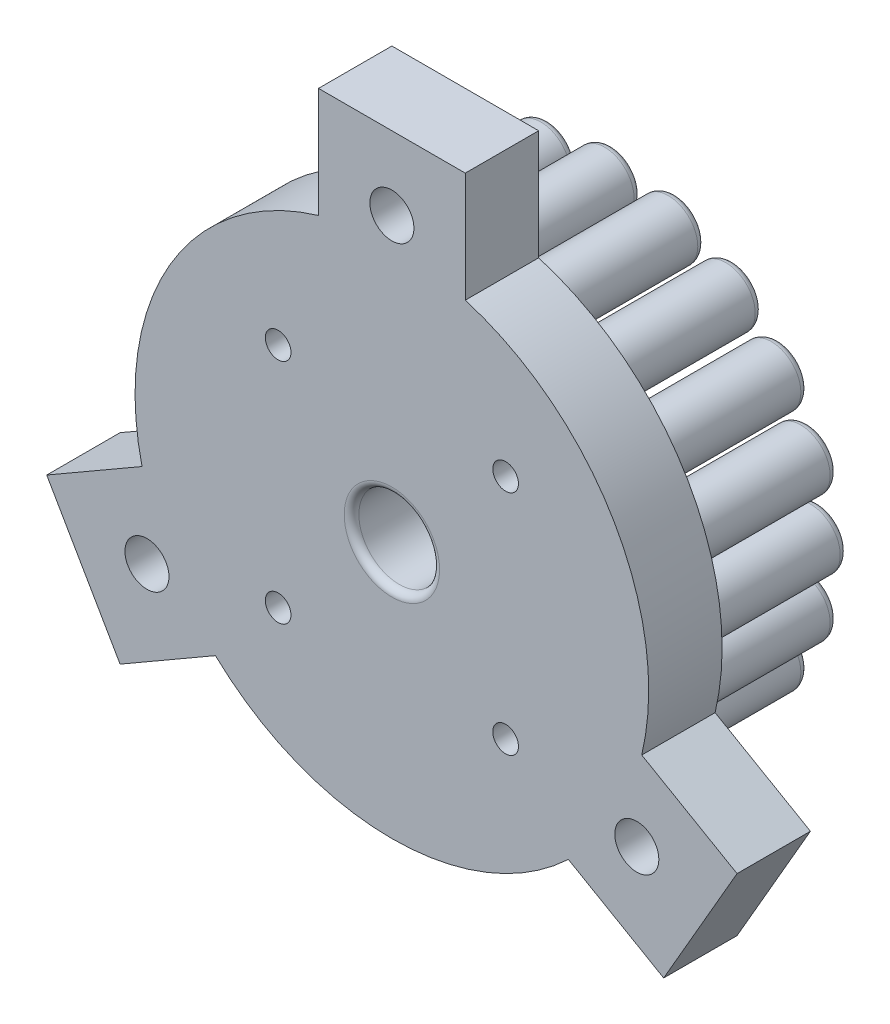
from build123d import *

# Parameters (mm, degrees)
SKIZZE1_R                          = 4
AUFSATZ_LINEAR_AUSTRAGEN1_DEPTH    = 20
AUFSATZ_LINEAR_AUSTRAGEN1_2_DEPTH  = 20
AUFSATZ_LINEAR_AUSTRAGEN1_3_DEPTH  = 20
AUFSATZ_LINEAR_AUSTRAGEN1_4_DEPTH  = 20
AUFSATZ_LINEAR_AUSTRAGEN1_5_DEPTH  = 20
AUFSATZ_LINEAR_AUSTRAGEN1_6_DEPTH  = 20
AUFSATZ_LINEAR_AUSTRAGEN1_7_DEPTH  = 20
AUFSATZ_LINEAR_AUSTRAGEN1_8_DEPTH  = 20
AUFSATZ_LINEAR_AUSTRAGEN1_9_DEPTH  = 20
AUFSATZ_LINEAR_AUSTRAGEN1_10_DEPTH = 20
AUFSATZ_LINEAR_AUSTRAGEN1_11_DEPTH = 20
AUFSATZ_LINEAR_AUSTRAGEN1_12_DEPTH = 20
AUFSATZ_LINEAR_AUSTRAGEN1_13_DEPTH = 20
AUFSATZ_LINEAR_AUSTRAGEN1_14_DEPTH = 20
AUFSATZ_LINEAR_AUSTRAGEN1_15_DEPTH = 20
AUFSATZ_LINEAR_AUSTRAGEN1_16_DEPTH = 20
AUFSATZ_LINEAR_AUSTRAGEN1_17_DEPTH = 20
AUFSATZ_LINEAR_AUSTRAGEN1_18_DEPTH = 20
AUFSATZ_LINEAR_AUSTRAGEN1_19_DEPTH = 20
AUFSATZ_LINEAR_AUSTRAGEN1_20_DEPTH = 20
SKIZZE5_R                          = 35
AUFSATZ_LINEAR_AUSTRAGEN2_DEPTH    = 10
SKIZZE6_R                          = 5.5
SCHNITT_LINEAR_AUSTRAGEN1_DEPTH    = 10
SKIZZE7_W                          = 20
SKIZZE7_H                          = 15
AUFSATZ_LINEAR_AUSTRAGEN3_DEPTH    = 10
SCHNITT_LINEAR_AUSTRAGEN3_REACH    = 75.951
SKIZZE9_R                          = 3
VERRUNDUNG1_R                      = 1
VERRUNDUNG2_R                      = 1
SKIZZE10_R                         = 1.75
SCHNITT_LINEAR_AUSTRAGEN4_DEPTH    = 10
SKIZZE12_R                         = 3.3
SCHNITT_LINEAR_AUSTRAGEN5_DEPTH    = 3


with BuildPart() as part:
    # Skizze1 → Aufsatz-Linear austragen1 (new body)
    with BuildSketch(Plane.XY):
        with Locations((0, 28.1)):
            Circle(SKIZZE1_R)
    extrude(amount=AUFSATZ_LINEAR_AUSTRAGEN1_DEPTH)



with BuildPart() as body_2:
    # Skizze1 → Aufsatz-Linear austragen1 2 (new body)
    with BuildSketch(Plane.XY):
        with Locations((8.683377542, 26.724688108)):
            Circle(SKIZZE1_R)
    extrude(amount=AUFSATZ_LINEAR_AUSTRAGEN1_2_DEPTH)


with BuildPart() as body_3:
    # Skizze1 → Aufsatz-Linear austragen1 3 (new body)
    with BuildSketch(Plane.XY):
        with Locations((16.516765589, 22.733377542)):
            Circle(SKIZZE1_R)
    extrude(amount=AUFSATZ_LINEAR_AUSTRAGEN1_3_DEPTH)


with BuildPart() as body_4:
    # Skizze1 → Aufsatz-Linear austragen1 4 (new body)
    with BuildSketch(Plane.XY):
        with Locations((22.733377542, 16.516765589)):
            Circle(SKIZZE1_R)
    extrude(amount=AUFSATZ_LINEAR_AUSTRAGEN1_4_DEPTH)


with BuildPart() as body_5:
    # Skizze1 → Aufsatz-Linear austragen1 5 (new body)
    with BuildSketch(Plane.XY):
        with Locations((26.724688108, 8.683377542)):
            Circle(SKIZZE1_R)
    extrude(amount=AUFSATZ_LINEAR_AUSTRAGEN1_5_DEPTH)


with BuildPart() as body_6:
    # Skizze1 → Aufsatz-Linear austragen1 6 (new body)
    with BuildSketch(Plane.XY):
        with Locations((28.1, 0)):
            Circle(SKIZZE1_R)
    extrude(amount=AUFSATZ_LINEAR_AUSTRAGEN1_6_DEPTH)


with BuildPart() as body_7:
    # Skizze1 → Aufsatz-Linear austragen1 7 (new body)
    with BuildSketch(Plane.XY):
        with Locations((26.724688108, -8.683377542)):
            Circle(SKIZZE1_R)
    extrude(amount=AUFSATZ_LINEAR_AUSTRAGEN1_7_DEPTH)


with BuildPart() as body_8:
    # Skizze1 → Aufsatz-Linear austragen1 8 (new body)
    with BuildSketch(Plane.XY):
        with Locations((22.733377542, -16.516765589)):
            Circle(SKIZZE1_R)
    extrude(amount=AUFSATZ_LINEAR_AUSTRAGEN1_8_DEPTH)


with BuildPart() as body_9:
    # Skizze1 → Aufsatz-Linear austragen1 9 (new body)
    with BuildSketch(Plane.XY):
        with Locations((16.516765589, -22.733377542)):
            Circle(SKIZZE1_R)
    extrude(amount=AUFSATZ_LINEAR_AUSTRAGEN1_9_DEPTH)


with BuildPart() as body_10:
    # Skizze1 → Aufsatz-Linear austragen1 10 (new body)
    with BuildSketch(Plane.XY):
        with Locations((8.683377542, -26.724688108)):
            Circle(SKIZZE1_R)
    extrude(amount=AUFSATZ_LINEAR_AUSTRAGEN1_10_DEPTH)


with BuildPart() as body_11:
    # Skizze1 → Aufsatz-Linear austragen1 11 (new body)
    with BuildSketch(Plane.XY):
        with Locations((0, -28.1)):
            Circle(SKIZZE1_R)
    extrude(amount=AUFSATZ_LINEAR_AUSTRAGEN1_11_DEPTH)


with BuildPart() as body_12:
    # Skizze1 → Aufsatz-Linear austragen1 12 (new body)
    with BuildSketch(Plane.XY):
        with Locations((-8.683377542, -26.724688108)):
            Circle(SKIZZE1_R)
    extrude(amount=AUFSATZ_LINEAR_AUSTRAGEN1_12_DEPTH)


with BuildPart() as body_13:
    # Skizze1 → Aufsatz-Linear austragen1 13 (new body)
    with BuildSketch(Plane.XY):
        with Locations((-16.516765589, -22.733377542)):
            Circle(SKIZZE1_R)
    extrude(amount=AUFSATZ_LINEAR_AUSTRAGEN1_13_DEPTH)


with BuildPart() as body_14:
    # Skizze1 → Aufsatz-Linear austragen1 14 (new body)
    with BuildSketch(Plane.XY):
        with Locations((-22.733377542, -16.516765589)):
            Circle(SKIZZE1_R)
    extrude(amount=AUFSATZ_LINEAR_AUSTRAGEN1_14_DEPTH)


with BuildPart() as body_15:
    # Skizze1 → Aufsatz-Linear austragen1 15 (new body)
    with BuildSketch(Plane.XY):
        with Locations((-26.724688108, -8.683377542)):
            Circle(SKIZZE1_R)
    extrude(amount=AUFSATZ_LINEAR_AUSTRAGEN1_15_DEPTH)


with BuildPart() as body_16:
    # Skizze1 → Aufsatz-Linear austragen1 16 (new body)
    with BuildSketch(Plane.XY):
        with Locations((-28.1, 0)):
            Circle(SKIZZE1_R)
    extrude(amount=AUFSATZ_LINEAR_AUSTRAGEN1_16_DEPTH)


with BuildPart() as body_17:
    # Skizze1 → Aufsatz-Linear austragen1 17 (new body)
    with BuildSketch(Plane.XY):
        with Locations((-26.724688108, 8.683377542)):
            Circle(SKIZZE1_R)
    extrude(amount=AUFSATZ_LINEAR_AUSTRAGEN1_17_DEPTH)


with BuildPart() as body_18:
    # Skizze1 → Aufsatz-Linear austragen1 18 (new body)
    with BuildSketch(Plane.XY):
        with Locations((-22.733377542, 16.516765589)):
            Circle(SKIZZE1_R)
    extrude(amount=AUFSATZ_LINEAR_AUSTRAGEN1_18_DEPTH)


with BuildPart() as body_19:
    # Skizze1 → Aufsatz-Linear austragen1 19 (new body)
    with BuildSketch(Plane.XY):
        with Locations((-16.516765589, 22.733377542)):
            Circle(SKIZZE1_R)
    extrude(amount=AUFSATZ_LINEAR_AUSTRAGEN1_19_DEPTH)


with BuildPart() as body_20:
    # Skizze1 → Aufsatz-Linear austragen1 20 (new body)
    with BuildSketch(Plane.XY):
        with Locations((-8.683377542, 26.724688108)):
            Circle(SKIZZE1_R)
    extrude(amount=AUFSATZ_LINEAR_AUSTRAGEN1_20_DEPTH)


with BuildPart() as part_1:
    add(part.part)

    add(body_2.part)  # Aufsatz-Linear austragen2 merges body 2

    add(body_3.part)  # Aufsatz-Linear austragen2 merges body 3

    add(body_4.part)  # Aufsatz-Linear austragen2 merges body 4

    add(body_5.part)  # Aufsatz-Linear austragen2 merges body 5

    add(body_6.part)  # Aufsatz-Linear austragen2 merges body 6

    add(body_7.part)  # Aufsatz-Linear austragen2 merges body 7

    add(body_8.part)  # Aufsatz-Linear austragen2 merges body 8

    add(body_9.part)  # Aufsatz-Linear austragen2 merges body 9

    add(body_10.part)  # Aufsatz-Linear austragen2 merges body 10

    add(body_11.part)  # Aufsatz-Linear austragen2 merges body 11

    add(body_12.part)  # Aufsatz-Linear austragen2 merges body 12

    add(body_13.part)  # Aufsatz-Linear austragen2 merges body 13

    add(body_14.part)  # Aufsatz-Linear austragen2 merges body 14

    add(body_15.part)  # Aufsatz-Linear austragen2 merges body 15

    add(body_16.part)  # Aufsatz-Linear austragen2 merges body 16

    add(body_17.part)  # Aufsatz-Linear austragen2 merges body 17

    add(body_18.part)  # Aufsatz-Linear austragen2 merges body 18

    add(body_19.part)  # Aufsatz-Linear austragen2 merges body 19

    add(body_20.part)  # Aufsatz-Linear austragen2 merges body 20
    # Skizze5 → Aufsatz-Linear austragen2 (add)
    with BuildSketch(Plane.XY.offset(20)):
        Circle(SKIZZE5_R)
    extrude(amount=AUFSATZ_LINEAR_AUSTRAGEN2_DEPTH)

    # Skizze6 → Schnitt-Linear austragen1 (cut)
    with BuildSketch(Plane.XY.offset(30)):
        Circle(SKIZZE6_R)
    extrude(amount=-SCHNITT_LINEAR_AUSTRAGEN1_DEPTH, mode=Mode.SUBTRACT)

    # Skizze7 → Aufsatz-Linear austragen3 (add)
    with BuildSketch(Plane.XY.offset(30)):
        with Locations((0, 41.041019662)):
            Rectangle(SKIZZE7_W, SKIZZE7_H)
        Polygon((34.047375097, -8.110255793), (47.037756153, -15.610255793), (37.037756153, -32.930763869), (24.047375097, -25.430763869), align=None)
        Polygon((-24.047375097, -25.430763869), (-37.037756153, -32.930763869), (-47.037756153, -15.610255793), (-34.047375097, -8.110255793), align=None)
    extrude(amount=-AUFSATZ_LINEAR_AUSTRAGEN3_DEPTH)

    # Skizze9 → Schnitt-Linear austragen3 (cut, up to next)
    with BuildSketch(Plane.XY.offset(30), mode=Mode.PRIVATE) as schnitt_linear_austragen3_sk1:
        with Locations((0, 38.541019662)):
            Circle(SKIZZE9_R)
    schnitt_linear_austragen3_tool1 = extrude(schnitt_linear_austragen3_sk1.sketch, amount=-SCHNITT_LINEAR_AUSTRAGEN3_REACH, mode=Mode.PRIVATE) & part_1.part
    # Skizze9 → Schnitt-Linear austragen3 (cut, up to next)
    with BuildSketch(Plane.XY.offset(30), mode=Mode.PRIVATE) as schnitt_linear_austragen3_sk2:
        with Locations((33.377502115, -19.270509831)):
            Circle(SKIZZE9_R)
    schnitt_linear_austragen3_tool2 = extrude(schnitt_linear_austragen3_sk2.sketch, amount=-SCHNITT_LINEAR_AUSTRAGEN3_REACH, mode=Mode.PRIVATE) & part_1.part
    # Skizze9 → Schnitt-Linear austragen3 (cut, up to next)
    with BuildSketch(Plane.XY.offset(30), mode=Mode.PRIVATE) as schnitt_linear_austragen3_sk3:
        with Locations((-33.377502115, -19.270509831)):
            Circle(SKIZZE9_R)
    schnitt_linear_austragen3_tool3 = extrude(schnitt_linear_austragen3_sk3.sketch, amount=-SCHNITT_LINEAR_AUSTRAGEN3_REACH, mode=Mode.PRIVATE) & part_1.part
    add(schnitt_linear_austragen3_tool1.solids().sort_by_distance((0, 38.54102, 30))[0], mode=Mode.SUBTRACT)
    add(schnitt_linear_austragen3_tool2.solids().sort_by_distance((33.377502, -19.27051, 30))[0], mode=Mode.SUBTRACT)
    add(schnitt_linear_austragen3_tool3.solids().sort_by_distance((-33.377502, -19.27051, 30))[0], mode=Mode.SUBTRACT)

    # Verrundung1
    verrundung1_edges = [part_1.edges().sort_by_distance(p)[0] for p in [
        (-5.5, 0, 20),
        (-5.5, 0, 30),
    ]]
    fillet(verrundung1_edges, radius=VERRUNDUNG1_R)

    # Verrundung2
    verrundung2_edges = [part_1.edges().sort_by_distance(p)[0] for p in [
        (24.1, 0, 0),
        (-26.733377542, -16.516765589, 0),
        (-30.724688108, -8.683377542, 0),
        (-32.1, 0, 0),
        (-30.724688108, 8.683377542, 0),
        (-26.733377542, 16.516765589, 0),
        (-20.516765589, 22.733377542, 0),
        (-12.683377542, 26.724688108, 0),
        (22.724688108, 8.683377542, 0),
        (18.733377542, 16.516765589, 0),
        (12.516765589, 22.733377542, 0),
        (4.683377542, 26.724688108, 0),
        (-4, 28.1, 0),
        (-20.516765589, -22.733377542, 0),
        (-12.683377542, -26.724688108, 0),
        (-4, -28.1, 0),
        (4.683377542, -26.724688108, 0),
        (12.516765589, -22.733377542, 0),
        (18.733377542, -16.516765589, 0),
        (22.724688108, -8.683377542, 0),
    ]]
    fillet(verrundung2_edges, radius=VERRUNDUNG2_R)

    # Skizze10 → Schnitt-Linear austragen4 (cut)
    with BuildSketch(Plane.XY.offset(30)):
        with Locations((-15.5, 15.5)):
            Circle(SKIZZE10_R)
        with Locations((15.5, 15.5)):
            Circle(SKIZZE10_R)
        with Locations((15.5, -15.5)):
            Circle(SKIZZE10_R)
        with Locations((-15.5, -15.5)):
            Circle(SKIZZE10_R)
    extrude(amount=-SCHNITT_LINEAR_AUSTRAGEN4_DEPTH, mode=Mode.SUBTRACT)

    # Skizze12 → Schnitt-Linear austragen5 (cut)
    with BuildSketch(Plane(origin=(0, 0, 20), x_dir=(-1, 0, 0), z_dir=(0, 0, -1))):
        with Locations((-15.5, 15.5)):
            Circle(SKIZZE12_R)
        with Locations((15.5, 15.5)):
            Circle(SKIZZE12_R)
        with Locations((-15.5, -15.5)):
            Circle(SKIZZE12_R)
        with Locations((15.5, -15.5)):
            Circle(SKIZZE12_R)
    extrude(amount=-SCHNITT_LINEAR_AUSTRAGEN5_DEPTH, mode=Mode.SUBTRACT)


solid = part_1.part
